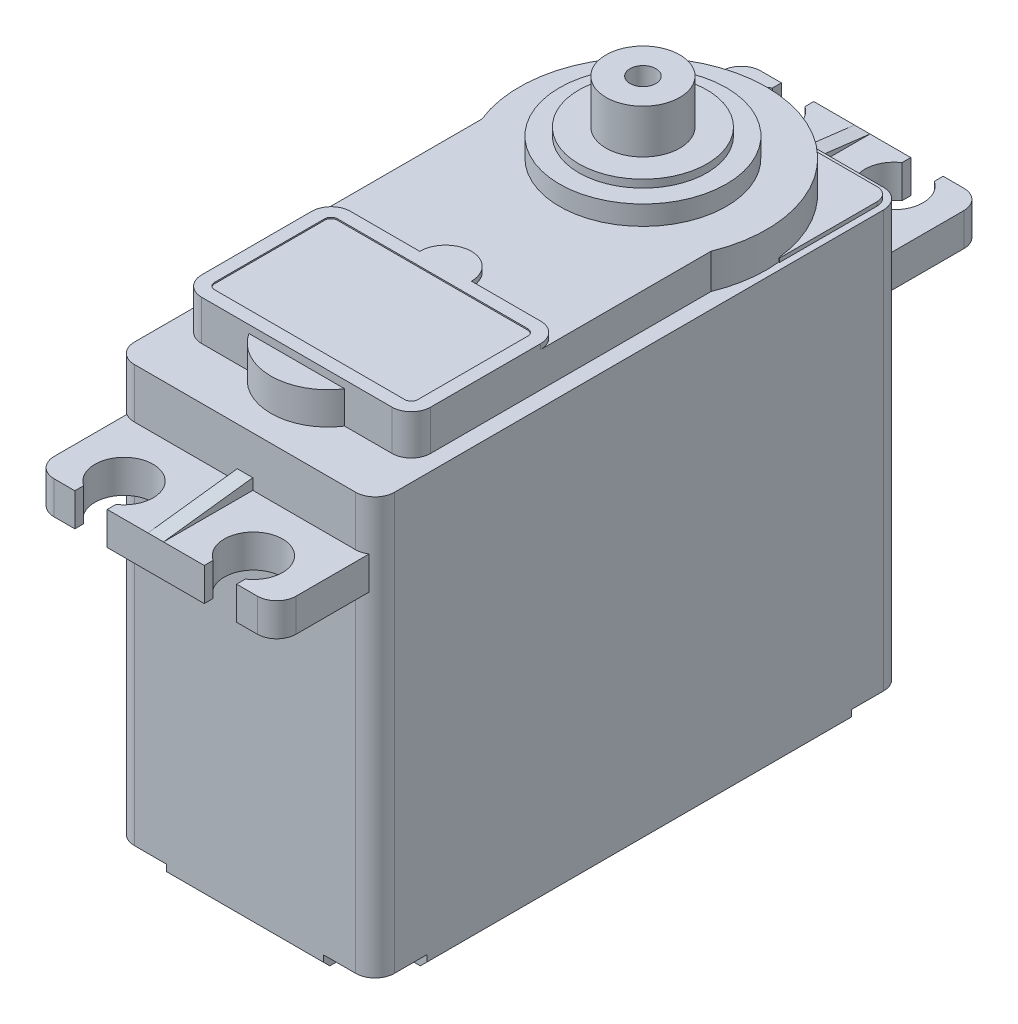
from build123d import *

# Parameters (mm, degrees)
BOSS_EXTRUDE1_DEPTH  = 33.2
BOSS_EXTRUDE2_DEPTH  = 2.55
BOSS_EXTRUDE11_DEPTH = 0.3
BOSS_EXTRUDE3_DEPTH  = 2.7
SKETCH6_R            = 4.4225
BOSS_EXTRUDE4_DEPTH  = 2.5
SKETCH7_R            = 6.45
BOSS_EXTRUDE5_DEPTH  = 1.5
SKETCH8_R            = 4.95
BOSS_EXTRUDE6_DEPTH  = 0.6
SKETCH10_R           = 2.85
BOSS_EXTRUDE7_DEPTH  = 3.4
SKETCH12_R           = 1
CUT_EXTRUDE1_DEPTH   = 5
BOSS_EXTRUDE9_DEPTH  = 0.4
BOSS_EXTRUDE10_DEPTH = 0.3
CHAMFER1_SIZE        = 0.5
CUT_EXTRUDE2_DEPTH   = 1
MIRROR2_COPY_1_DEPTH = 1
BOSS_EXTRUDE12_DEPTH = 0.6


with BuildPart() as part:
    # Sketch1 → Boss-Extrude1 (new body)
    with BuildSketch(Plane(origin=(0, 0, 0), x_dir=(1, 0, 0), z_dir=(0, 1, 0))):
        with BuildLine():
            Line((-8.55, -25.58), (8.55, -25.58))
            ThreePointArc((8.55, -25.58), (9.610660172, -25.140660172), (10.05, -24.08))
            Line((10.05, -24.08), (10.05, 13.72))
            ThreePointArc((10.05, 13.72), (9.610660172, 14.780660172), (8.55, 15.22))
            Line((8.55, 15.22), (-8.55, 15.22))
            ThreePointArc((-8.55, 15.22), (-9.610660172, 14.780660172), (-10.05, 13.72))
            Line((-10.05, 13.72), (-10.05, -24.08))
            ThreePointArc((-10.05, -24.08), (-9.610660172, -25.140660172), (-8.55, -25.58))
        make_face()
    extrude(amount=BOSS_EXTRUDE1_DEPTH)

    # Sketch4 → Boss-Extrude2 (add)
    with BuildSketch(Plane(origin=(0, 26.8, 0), x_dir=(1, 0, 0), z_dir=(0, 1, 0))):
        with BuildLine():
            Line((-6.25, 22.12), (-6.25, 21.440828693))
            ThreePointArc((-6.25, 21.440828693), (-5, 17.32), (-3.75, 21.440828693))
            Line((-3.75, 21.440828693), (-3.75, 22.12))
            Line((-3.75, 22.12), (3.75, 22.12))
            Line((3.75, 22.12), (3.75, 21.440828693))
            ThreePointArc((3.75, 21.440828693), (5, 17.32), (6.25, 21.440828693))
            Line((6.25, 21.440828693), (6.25, 22.12))
            Line((6.25, 22.12), (7.85, 22.12))
            ThreePointArc((7.85, 22.12), (8.910660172, 21.680660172), (9.35, 20.62))
            Line((9.35, 20.62), (9.35, -30.98))
            ThreePointArc((9.35, -30.98), (8.910660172, -32.040660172), (7.85, -32.48))
            Line((7.85, -32.48), (6.25, -32.48))
            Line((6.25, -32.48), (6.25, -31.800828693))
            ThreePointArc((6.25, -31.800828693), (5, -27.68), (3.75, -31.800828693))
            Line((3.75, -31.800828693), (3.75, -32.48))
            Line((3.75, -32.48), (-3.75, -32.48))
            Line((-3.75, -32.48), (-3.75, -31.800828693))
            ThreePointArc((-3.75, -31.800828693), (-5, -27.68), (-6.25, -31.800828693))
            Line((-6.25, -31.800828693), (-6.25, -32.48))
            Line((-6.25, -32.48), (-7.85, -32.48))
            ThreePointArc((-7.85, -32.48), (-8.910660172, -32.040660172), (-9.35, -30.98))
            Line((-9.35, -30.98), (-9.35, 20.62))
            ThreePointArc((-9.35, 20.62), (-8.910660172, 21.680660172), (-7.85, 22.12))
            Line((-7.85, 22.12), (-6.25, 22.12))
        make_face()
    extrude(amount=BOSS_EXTRUDE2_DEPTH)

    # Sketch16 → Boss-Extrude11 (add)
    with BuildSketch(Plane(origin=(0, 33.2, 0), x_dir=(1, 0, 0), z_dir=(0, 1, 0))):
        with BuildLine():
            Line((-9.55, 13.72), (-9.55, 6.17))
            Line((-9.55, 6.17), (0, 6.17))
            Line((0, 6.17), (0, 14.72))
            Line((0, 14.72), (-8.55, 14.72))
            ThreePointArc((-8.55, 14.72), (-9.257106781, 14.427106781), (-9.55, 13.72))
        make_face()
        with BuildLine():
            Line((0, 14.72), (0, 6.17))
            Line((0, 6.17), (9.55, 6.17))
            Line((9.55, 6.17), (9.55, 13.72))
            ThreePointArc((9.55, 13.72), (9.257106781, 14.427106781), (8.55, 14.72))
            Line((8.55, 14.72), (0, 14.72))
        make_face()
    extrude(amount=BOSS_EXTRUDE11_DEPTH)

    # Sketch5 → Boss-Extrude3 (add)
    with BuildSketch(Plane(origin=(0, 33.2, 0), x_dir=(1, 0, 0), z_dir=(0, 1, 0))):
        with BuildLine():
            Line((-8.85, 1.581128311), (-8.85, -20.08))
            ThreePointArc((-8.85, -20.08), (-8.410660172, -21.140660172), (-7.35, -21.58))
            Line((-7.35, -21.58), (7.35, -21.58))
            ThreePointArc((7.35, -21.58), (8.410660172, -21.140660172), (8.85, -20.08))
            Line((8.85, -20.08), (8.85, 1.581128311))
            ThreePointArc((8.85, 1.581128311), (0, 14.72), (-8.85, 1.581128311))
        make_face()
    extrude(amount=BOSS_EXTRUDE3_DEPTH)

    # Sketch6 → Boss-Extrude4 (add)
    with BuildSketch(Plane(origin=(0, 33.2, 0), x_dir=(1, 0, 0), z_dir=(0, 1, 0))):
        with Locations((0, -19.1575)):
            Circle(SKETCH6_R)
    extrude(amount=BOSS_EXTRUDE4_DEPTH)

    # Sketch7 → Boss-Extrude5 (add)
    with BuildSketch(Plane(origin=(0, 35.9, 0), x_dir=(1, 0, 0), z_dir=(0, 1, 0))):
        with Locations(Location((0, 5.17, 0), (0, 0, 90))):
            Circle(SKETCH7_R)
    extrude(amount=BOSS_EXTRUDE5_DEPTH)

    # Sketch8 → Boss-Extrude6 (add)
    with BuildSketch(Plane(origin=(0, 37.4, 0), x_dir=(1, 0, 0), z_dir=(0, 1, 0))):
        with Locations(Location((0, 5.17, 0), (0, 0, 270))):
            Circle(SKETCH8_R)
    extrude(amount=BOSS_EXTRUDE6_DEPTH)

    # Sketch10 → Boss-Extrude7 (add)
    with BuildSketch(Plane(origin=(0, 38, 0), x_dir=(1, 0, 0), z_dir=(0, 1, 0))):
        with Locations(Location((0, 5.17, 0), (0, 0, 270))):
            Circle(SKETCH10_R)
    extrude(amount=BOSS_EXTRUDE7_DEPTH)

    # Sketch12 → Cut-Extrude1 (cut)
    with BuildSketch(Plane(origin=(0, 41.4, 0), x_dir=(1, 0, 0), z_dir=(0, 1, 0))):
        with Locations(Location((0, 5.17, 0), (0, 0, 270))):
            Circle(SKETCH12_R)
    extrude(amount=-CUT_EXTRUDE1_DEPTH, mode=Mode.SUBTRACT)

    # Sketch13 → Boss-Extrude9 (add)
    with BuildSketch(Plane(origin=(0, 35.9, 0), x_dir=(1, 0, 0), z_dir=(0, 1, 0))):
        with BuildLine():
            Line((-8.85, -11.58), (-8.85, -20.08))
            ThreePointArc((-8.85, -20.08), (-8.410660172, -21.140660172), (-7.35, -21.58))
            Line((-7.35, -21.58), (7.35, -21.58))
            ThreePointArc((7.35, -21.58), (8.410660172, -21.140660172), (8.85, -20.08))
            Line((8.85, -20.08), (8.85, -11.58))
            ThreePointArc((8.85, -11.58), (8.410660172, -10.519339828), (7.35, -10.08))
            Line((7.35, -10.08), (2, -10.08))
            ThreePointArc((2, -10.08), (0, -8.08), (-2, -10.08))
            Line((-2, -10.08), (-7.35, -10.08))
            ThreePointArc((-7.35, -10.08), (-8.410660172, -10.519339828), (-8.85, -11.58))
        make_face()
        with BuildLine():
            Line((-7.85, -11.58), (-7.85, -20.08))
            ThreePointArc((-7.85, -20.08), (-7.703553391, -20.433553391), (-7.35, -20.58))
            Line((-7.35, -20.58), (7.35, -20.58))
            ThreePointArc((7.35, -20.58), (7.703553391, -20.433553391), (7.85, -20.08))
            Line((7.85, -20.08), (7.85, -11.58))
            ThreePointArc((7.85, -11.58), (7.703553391, -11.226446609), (7.35, -11.08))
            Line((7.35, -11.08), (-7.35, -11.08))
            ThreePointArc((-7.35, -11.08), (-7.703553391, -11.226446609), (-7.85, -11.58))
        make_face(mode=Mode.SUBTRACT)
    extrude(amount=BOSS_EXTRUDE9_DEPTH)

    # Sketch14 → Boss-Extrude10 (add)
    with BuildSketch(Plane(origin=(0, 35.9, 0), x_dir=(1, 0, 0), z_dir=(0, 1, 0))):
        with BuildLine():
            Line((-7.85, -11.58), (-7.85, -20.08))
            ThreePointArc((-7.85, -20.08), (-7.703553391, -20.433553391), (-7.35, -20.58))
            Line((-7.35, -20.58), (7.35, -20.58))
            ThreePointArc((7.35, -20.58), (7.703553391, -20.433553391), (7.85, -20.08))
            Line((7.85, -20.08), (7.85, -11.58))
            ThreePointArc((7.85, -11.58), (7.703553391, -11.226446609), (7.35, -11.08))
            Line((7.35, -11.08), (-7.35, -11.08))
            ThreePointArc((-7.35, -11.08), (-7.703553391, -11.226446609), (-7.85, -11.58))
        make_face()
    extrude(amount=BOSS_EXTRUDE10_DEPTH)

    # Chamfer1
    chamfer1_edges = [part.edges().sort_by_distance(p)[0] for p in [
        (-10.05, 0, 5.18),
        (-9.610660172, 0, -14.780660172),
        (0, 0, -15.22),
        (9.610660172, 0, -14.780660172),
        (10.05, 0, 5.18),
        (9.610660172, 0, 25.140660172),
        (0, 0, 25.58),
        (-9.610660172, 0, 25.140660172),
    ]]
    chamfer(chamfer1_edges, length=CHAMFER1_SIZE)

    # Sketch17 → Cut-Extrude2 (cut)
    with BuildSketch(Plane.XZ):
        with BuildLine():
            Line((-10.05, 21.58), (-10.05, 24.08))
            ThreePointArc((-10.05, 24.08), (-9.610660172, 25.140660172), (-8.55, 25.58))
            Line((-8.55, 25.58), (-6.05, 25.58))
            Line((-6.05, 25.58), (-6.05, 23.08))
            ThreePointArc((-6.05, 23.08), (-6.489339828, 22.019339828), (-7.55, 21.58))
            Line((-7.55, 21.58), (-10.05, 21.58))
        make_face()
    cut_extrude2 = extrude(amount=-CUT_EXTRUDE2_DEPTH, mode=Mode.SUBTRACT)

    # Mirror1: Cut-Extrude2 across plane
    add(cut_extrude2.mirror(Plane(origin=(0, 0, 0), x_dir=(0, 0, 1), z_dir=(1, 0, 0))), mode=Mode.SUBTRACT)

    # Mirror2: Cut-Extrude2 across plane
    add(cut_extrude2.mirror(Plane.XY.offset(5.18)), mode=Mode.SUBTRACT)

    # Mirror2 copy 1 sketch → Mirror2 copy 1 (cut)
    with BuildSketch(Plane(origin=(0, 0, 10.36), x_dir=(-1, 0, 0), z_dir=(0, -1, 0))):
        with BuildLine():
            Line((-10.05, 21.58), (-10.05, 24.08))
            ThreePointArc((-10.05, 24.08), (-9.610660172, 25.140660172), (-8.55, 25.58))
            Line((-8.55, 25.58), (-6.05, 25.58))
            Line((-6.05, 25.58), (-6.05, 23.08))
            ThreePointArc((-6.05, 23.08), (-6.489339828, 22.019339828), (-7.55, 21.58))
            Line((-7.55, 21.58), (-10.05, 21.58))
        make_face()
    extrude(amount=-MIRROR2_COPY_1_DEPTH, mode=Mode.SUBTRACT)

    # Sketch19 → Boss-Extrude12 (add, symmetric)
    with BuildSketch(Plane(origin=(0, 0, 0), x_dir=(0, 0, -1), z_dir=(1, 0, 0))):
        Polygon((-25.58, 30.2), (-25.58, 29.35), (-32.48, 29.35), align=None)
        Polygon((15.22, 30.2), (15.22, 29.35), (22.12, 29.35), align=None)
    extrude(amount=BOSS_EXTRUDE12_DEPTH, both=True)


solid = part.part
